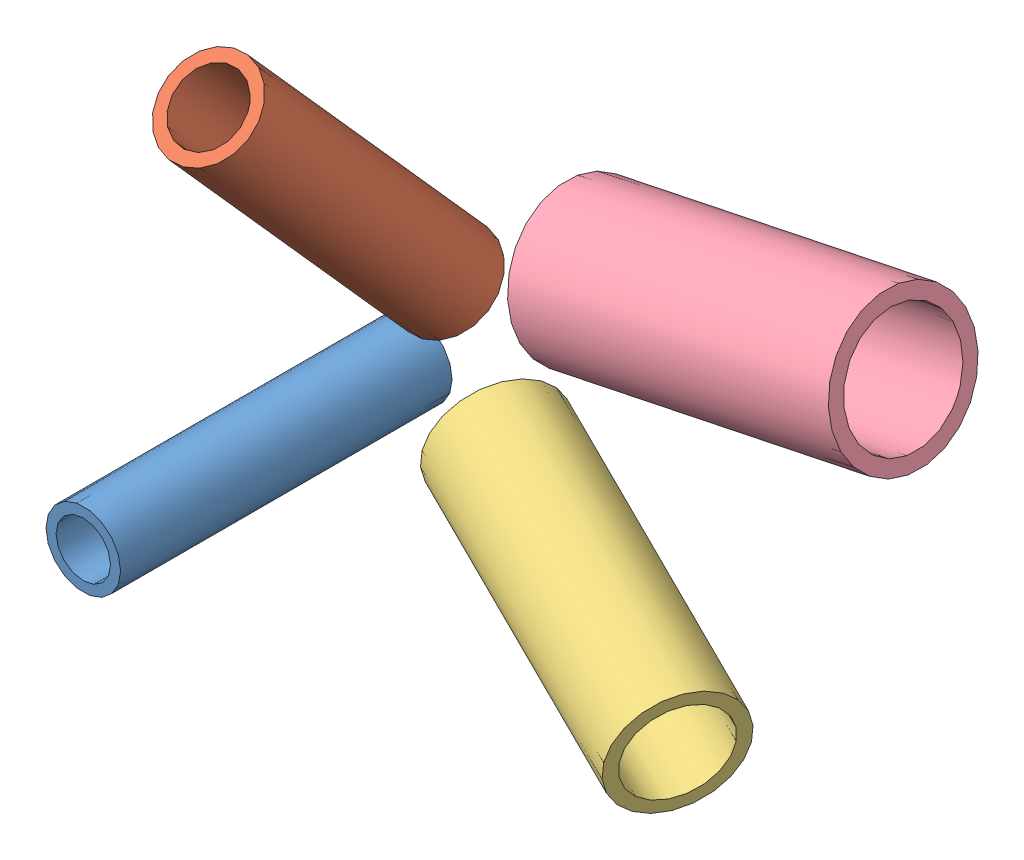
SolidWorks assembly test.assembly.SLDASM, configuration Default (file format 11000). Lengths in mm.
Overall size (117.74 120.62 108.46).
4 component instances, 4 part files, 0 mates.
Components (placement in the parent):
- test.pipe.A-1: test.pipe.A.SLDPRT [Default] at origin size (17.14 17.14 76.2)
- test.pipe.B-1: test.pipe.B.SLDPRT [Default] at (13.2022 24.9898 5.5658) x (0.870664 0.364182 -0.330629) z (-0.062396 0.748519 0.660171) size (21.34 21.34 76.2)
- test.pipe.C-1: test.pipe.C.SLDPRT [Default] at (28.773 3.0966 10.1199) x (0.175257 -0.642744 -0.745764) z (0.913863 -0.175587 0.366092) size (26.67 26.67 76.2)
- test.pipe.D-1: test.pipe.D.SLDPRT [Default] at (29.7129 27.7447 -8.8101) x (0.138157 -0.603162 -0.785562) z (0.97741 0.211123 0.009794) size (33.4 33.4 76.2)
